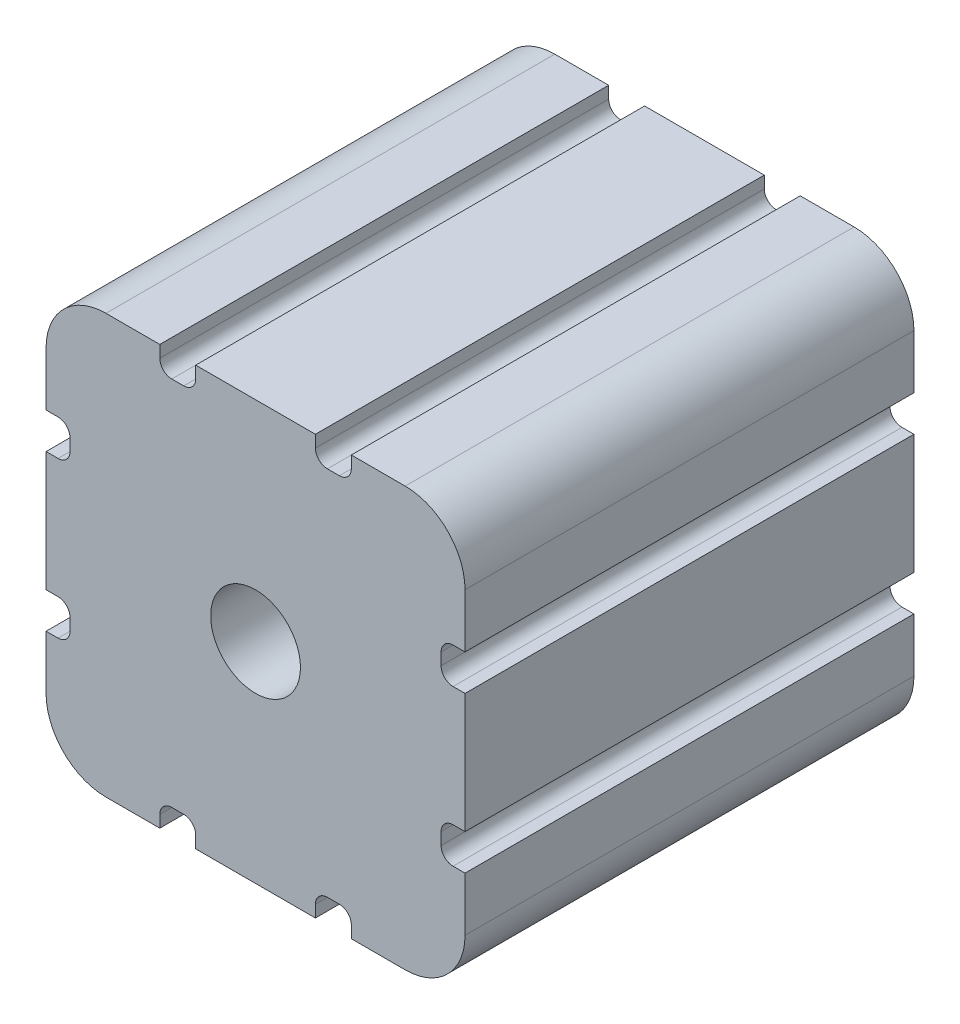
from build123d import *

# Parameters (mm, degrees)
ESQUISSE1_W                  = 70
ESQUISSE1_H                  = 70
BASE_EXTRUSION_DEPTH         = 75
ESQUISSE2_R                  = 7.5
ENL_V_MAT_EXTRU_1_DEPTH      = 67
CONG_1_R                     = 10
ENL_V_MAT_EXTRU_2_DEPTH      = 125.197423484
R_P_TITION_CIRCULAIRE1_COUNT = 4


with BuildPart() as part:
    # Esquisse1 → Base-Extrusion (new body)
    with BuildSketch(Plane.XY):
        with Locations((35, 35)):
            Rectangle(ESQUISSE1_W, ESQUISSE1_H)
    extrude(amount=BASE_EXTRUSION_DEPTH)

    # Esquisse2 → Enl_v. mat.-Extru.1 (cut)
    with BuildSketch(Plane.XY.offset(75)):
        with Locations((35, 35)):
            Circle(ESQUISSE2_R)
    extrude(amount=-ENL_V_MAT_EXTRU_1_DEPTH, mode=Mode.SUBTRACT)

    # Cong_1
    cong_1_edges = [part.edges().sort_by_distance(p)[0] for p in [
        (0, 0, 37.5),
        (70, 0, 37.5),
        (0, 70, 37.5),
        (70, 70, 37.5),
    ]]
    fillet(cong_1_edges, radius=CONG_1_R)

    # Esquisse3 → Enl_v. mat.-Extru.2 (cut, through all)
    with BuildSketch(Plane.XY.offset(75)):
        with BuildLine():
            Line((19, 70), (25, 70))
            Line((25, 70), (25, 68))
            ThreePointArc((25, 68), (24.414213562, 66.585786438), (23, 66))
            Line((23, 66), (21, 66))
            ThreePointArc((21, 66), (19.585786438, 66.585786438), (19, 68))
            Line((19, 68), (19, 70))
        make_face()
        with BuildLine():
            Line((45, 70), (45, 68))
            ThreePointArc((45, 68), (45.585786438, 66.585786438), (47, 66))
            Line((47, 66), (49, 66))
            ThreePointArc((49, 66), (50.414213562, 66.585786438), (51, 68))
            Line((51, 68), (51, 70))
            Line((51, 70), (45, 70))
        make_face()
    enl_v_mat_extru_2 = extrude(amount=-ENL_V_MAT_EXTRU_2_DEPTH, mode=Mode.SUBTRACT)

    # R_p_tition circulaire1: Enl_v. mat.-Extru.2 ×4 about axis
    r_p_tition_circulaire1_axis = Axis((35, 35, 0), (0, 0, 1))
    for i in range(1, R_P_TITION_CIRCULAIRE1_COUNT):
        add(enl_v_mat_extru_2.rotate(r_p_tition_circulaire1_axis, i * 360 / R_P_TITION_CIRCULAIRE1_COUNT), mode=Mode.SUBTRACT)


solid = part.part
